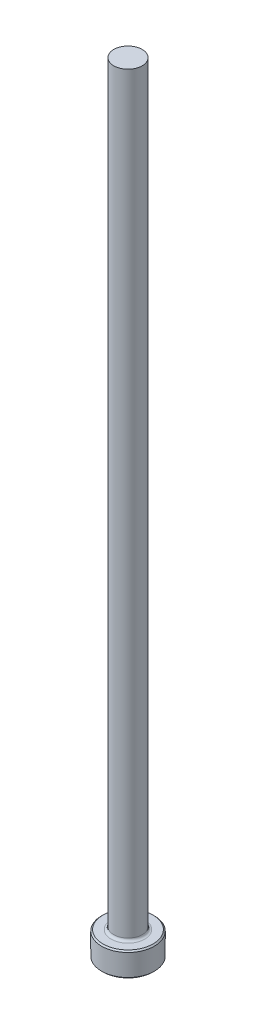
ISO-10303-21;
HEADER;
FILE_DESCRIPTION(('STEP AP214'),'2;1');
FILE_NAME('part.step','',(''),(''),'','','');
FILE_SCHEMA(('AUTOMOTIVE_DESIGN { 1 0 10303 214 1 1 1 1 }'));
ENDSEC;
DATA;
#1=APPLICATION_CONTEXT('core data for automotive mechanical design processes');
#2=APPLICATION_PROTOCOL_DEFINITION('international standard','automotive_design',2000,#1);
#3=PRODUCT_CONTEXT('',#1,'mechanical');
#4=PRODUCT('Part','Part','',(#3));
#5=PRODUCT_RELATED_PRODUCT_CATEGORY('part','',(#4));
#6=PRODUCT_DEFINITION_FORMATION('','',#4);
#7=PRODUCT_DEFINITION_CONTEXT('part definition',#1,'design');
#8=PRODUCT_DEFINITION('design','',#6,#7);
#9=PRODUCT_DEFINITION_SHAPE('','',#8);
#10=(LENGTH_UNIT() NAMED_UNIT(*) SI_UNIT(.MILLI.,.METRE.));
#11=(NAMED_UNIT(*) PLANE_ANGLE_UNIT() SI_UNIT($,.RADIAN.));
#12=(NAMED_UNIT(*) SI_UNIT($,.STERADIAN.) SOLID_ANGLE_UNIT());
#13=UNCERTAINTY_MEASURE_WITH_UNIT(LENGTH_MEASURE(1.E-05),#10,'distance_accuracy_value','');
#14=(GEOMETRIC_REPRESENTATION_CONTEXT(3) GLOBAL_UNCERTAINTY_ASSIGNED_CONTEXT((#13)) GLOBAL_UNIT_ASSIGNED_CONTEXT((#10,
#11,#12)) REPRESENTATION_CONTEXT('',''));
#15=CARTESIAN_POINT('',(0.,0.,0.));
#16=DIRECTION('',(0.,0.,1.));
#17=DIRECTION('',(1.,0.,0.));
#18=AXIS2_PLACEMENT_3D('',#15,#16,#17);
#19=CARTESIAN_POINT('',(0.,0.,0.));
#20=DIRECTION('',(0.,-1.,0.));
#21=DIRECTION('',(0.,0.,-1.));
#22=AXIS2_PLACEMENT_3D('',#19,#20,#21);
#23=PLANE('',#22);
#24=CARTESIAN_POINT('',(0.,0.,0.));
#25=DIRECTION('',(0.,-1.,0.));
#26=DIRECTION('',(0.,0.,-1.));
#27=AXIS2_PLACEMENT_3D('',#24,#25,#26);
#28=CIRCLE('',#27,4.90220000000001);
#29=CARTESIAN_POINT('',(0.,0.,-4.90220000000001));
#30=VERTEX_POINT('',#29);
#31=EDGE_CURVE('E46',#30,#30,#28,.T.);
#32=ORIENTED_EDGE('',*,*,#31,.T.);
#33=EDGE_LOOP('',(#32));
#34=FACE_BOUND('',#33,.T.);
#35=ADVANCED_FACE('F35',(#34),#23,.T.);
#36=CARTESIAN_POINT('',(0.,259.958771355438,0.));
#37=DIRECTION('',(0.,1.,0.));
#38=DIRECTION('',(0.,0.,1.));
#39=AXIS2_PLACEMENT_3D('',#36,#37,#38);
#40=CYLINDRICAL_SURFACE('',#39,5.15619999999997);
#41=CARTESIAN_POINT('',(0.,4.49580000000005,0.));
#42=DIRECTION('',(0.,1.,0.));
#43=DIRECTION('',(0.,0.,1.));
#44=AXIS2_PLACEMENT_3D('',#41,#42,#43);
#45=CIRCLE('',#44,5.15619999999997);
#46=CARTESIAN_POINT('',(0.,4.49580000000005,5.15619999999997));
#47=VERTEX_POINT('',#46);
#48=EDGE_CURVE('E50',#47,#47,#45,.F.);
#49=ORIENTED_EDGE('',*,*,#48,.T.);
#50=EDGE_LOOP('',(#49));
#51=FACE_BOUND('',#50,.T.);
#52=CARTESIAN_POINT('',(0.,0.253999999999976,0.));
#53=DIRECTION('',(0.,-1.,0.));
#54=DIRECTION('',(0.,0.,-1.));
#55=AXIS2_PLACEMENT_3D('',#52,#53,#54);
#56=CIRCLE('',#55,5.15619999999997);
#57=CARTESIAN_POINT('',(0.,0.253999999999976,-5.15619999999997));
#58=VERTEX_POINT('',#57);
#59=EDGE_CURVE('E55',#58,#58,#56,.F.);
#60=ORIENTED_EDGE('',*,*,#59,.T.);
#61=EDGE_LOOP('',(#60));
#62=FACE_BOUND('',#61,.T.);
#63=ADVANCED_FACE('F77',(#51,#62),#40,.T.);
#64=CARTESIAN_POINT('',(-5.15619999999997,4.7498,0.));
#65=DIRECTION('',(0.,1.,0.));
#66=DIRECTION('',(0.,0.,1.));
#67=AXIS2_PLACEMENT_3D('',#64,#65,#66);
#68=PLANE('',#67);
#69=CARTESIAN_POINT('',(0.,4.7498,0.));
#70=DIRECTION('',(0.,1.,0.));
#71=DIRECTION('',(0.,0.,1.));
#72=AXIS2_PLACEMENT_3D('',#69,#70,#71);
#73=CIRCLE('',#72,3.28548999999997);
#74=CARTESIAN_POINT('',(0.,4.7498,3.28548999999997));
#75=VERTEX_POINT('',#74);
#76=EDGE_CURVE('E10',#75,#75,#73,.F.);
#77=ORIENTED_EDGE('',*,*,#76,.T.);
#78=EDGE_LOOP('',(#77));
#79=FACE_BOUND('',#78,.T.);
#80=CARTESIAN_POINT('',(0.,4.7498,0.));
#81=DIRECTION('',(0.,1.,0.));
#82=DIRECTION('',(0.,0.,1.));
#83=AXIS2_PLACEMENT_3D('',#80,#81,#82);
#84=CIRCLE('',#83,4.90220000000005);
#85=CARTESIAN_POINT('',(0.,4.7498,4.90220000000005));
#86=VERTEX_POINT('',#85);
#87=EDGE_CURVE('E58',#86,#86,#84,.T.);
#88=ORIENTED_EDGE('',*,*,#87,.T.);
#89=EDGE_LOOP('',(#88));
#90=FACE_BOUND('',#89,.T.);
#91=ADVANCED_FACE('F69',(#79,#90),#68,.T.);
#92=CARTESIAN_POINT('',(0.,259.958771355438,0.));
#93=DIRECTION('',(0.,1.,0.));
#94=DIRECTION('',(0.,0.,1.));
#95=AXIS2_PLACEMENT_3D('',#92,#93,#94);
#96=CYLINDRICAL_SURFACE('',#95,2.77748999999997);
#97=CARTESIAN_POINT('',(0.,5.25779999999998,0.));
#98=DIRECTION('',(0.,1.,0.));
#99=DIRECTION('',(0.,0.,1.));
#100=AXIS2_PLACEMENT_3D('',#97,#98,#99);
#101=CIRCLE('',#100,2.77748999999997);
#102=CARTESIAN_POINT('',(0.,5.25779999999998,2.77748999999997));
#103=VERTEX_POINT('',#102);
#104=EDGE_CURVE('E42',#103,#103,#101,.T.);
#105=ORIENTED_EDGE('',*,*,#104,.T.);
#106=EDGE_LOOP('',(#105));
#107=FACE_BOUND('',#106,.T.);
#108=CARTESIAN_POINT('',(0.,152.4,0.));
#109=DIRECTION('',(0.,1.,0.));
#110=DIRECTION('',(0.,0.,1.));
#111=AXIS2_PLACEMENT_3D('',#108,#109,#110);
#112=CIRCLE('',#111,2.77748999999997);
#113=CARTESIAN_POINT('',(0.,152.4,2.77748999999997));
#114=VERTEX_POINT('',#113);
#115=EDGE_CURVE('E61',#114,#114,#112,.T.);
#116=ORIENTED_EDGE('',*,*,#115,.F.);
#117=EDGE_LOOP('',(#116));
#118=FACE_BOUND('',#117,.T.);
#119=ADVANCED_FACE('F67',(#107,#118),#96,.T.);
#120=CARTESIAN_POINT('',(-2.77748999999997,152.4,0.));
#121=DIRECTION('',(0.,1.,0.));
#122=DIRECTION('',(0.,0.,1.));
#123=AXIS2_PLACEMENT_3D('',#120,#121,#122);
#124=PLANE('',#123);
#125=ORIENTED_EDGE('',*,*,#115,.T.);
#126=EDGE_LOOP('',(#125));
#127=FACE_BOUND('',#126,.T.);
#128=ADVANCED_FACE('F65',(#127),#124,.T.);
#129=CARTESIAN_POINT('',(0.,4.74980000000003,0.));
#130=DIRECTION('',(0.,-1.,0.));
#131=DIRECTION('',(0.,0.,-1.));
#132=AXIS2_PLACEMENT_3D('',#129,#130,#131);
#133=CONICAL_SURFACE('',#132,4.90220000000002,0.785398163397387);
#134=ORIENTED_EDGE('',*,*,#48,.F.);
#135=EDGE_LOOP('',(#134));
#136=FACE_BOUND('',#135,.T.);
#137=ORIENTED_EDGE('',*,*,#87,.F.);
#138=EDGE_LOOP('',(#137));
#139=FACE_BOUND('',#138,.T.);
#140=ADVANCED_FACE('F75',(#136,#139),#133,.T.);
#141=CARTESIAN_POINT('',(0.,0.253999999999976,0.));
#142=DIRECTION('',(0.,1.,0.));
#143=DIRECTION('',(0.,0.,1.));
#144=AXIS2_PLACEMENT_3D('',#141,#142,#143);
#145=CONICAL_SURFACE('',#144,5.15619999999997,0.785398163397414);
#146=ORIENTED_EDGE('',*,*,#31,.F.);
#147=EDGE_LOOP('',(#146));
#148=FACE_BOUND('',#147,.T.);
#149=ORIENTED_EDGE('',*,*,#59,.F.);
#150=EDGE_LOOP('',(#149));
#151=FACE_BOUND('',#150,.T.);
#152=ADVANCED_FACE('F89',(#148,#151),#145,.T.);
#153=CARTESIAN_POINT('',(0.,5.25779999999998,0.));
#154=DIRECTION('',(0.,1.,0.));
#155=DIRECTION('',(0.,0.,1.));
#156=AXIS2_PLACEMENT_3D('',#153,#154,#155);
#157=TOROIDAL_SURFACE('',#156,3.28548999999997,0.508);
#158=ORIENTED_EDGE('',*,*,#76,.F.);
#159=EDGE_LOOP('',(#158));
#160=FACE_BOUND('',#159,.T.);
#161=ORIENTED_EDGE('',*,*,#104,.F.);
#162=EDGE_LOOP('',(#161));
#163=FACE_BOUND('',#162,.T.);
#164=ADVANCED_FACE('F37',(#160,#163),#157,.F.);
#165=CLOSED_SHELL('',(#35,#63,#91,#119,#128,#140,#152,#164));
#166=MANIFOLD_SOLID_BREP('B2',#165);
#167=ADVANCED_BREP_SHAPE_REPRESENTATION('',(#18,#166),#14);
#168=SHAPE_DEFINITION_REPRESENTATION(#9,#167);
ENDSEC;
END-ISO-10303-21;
